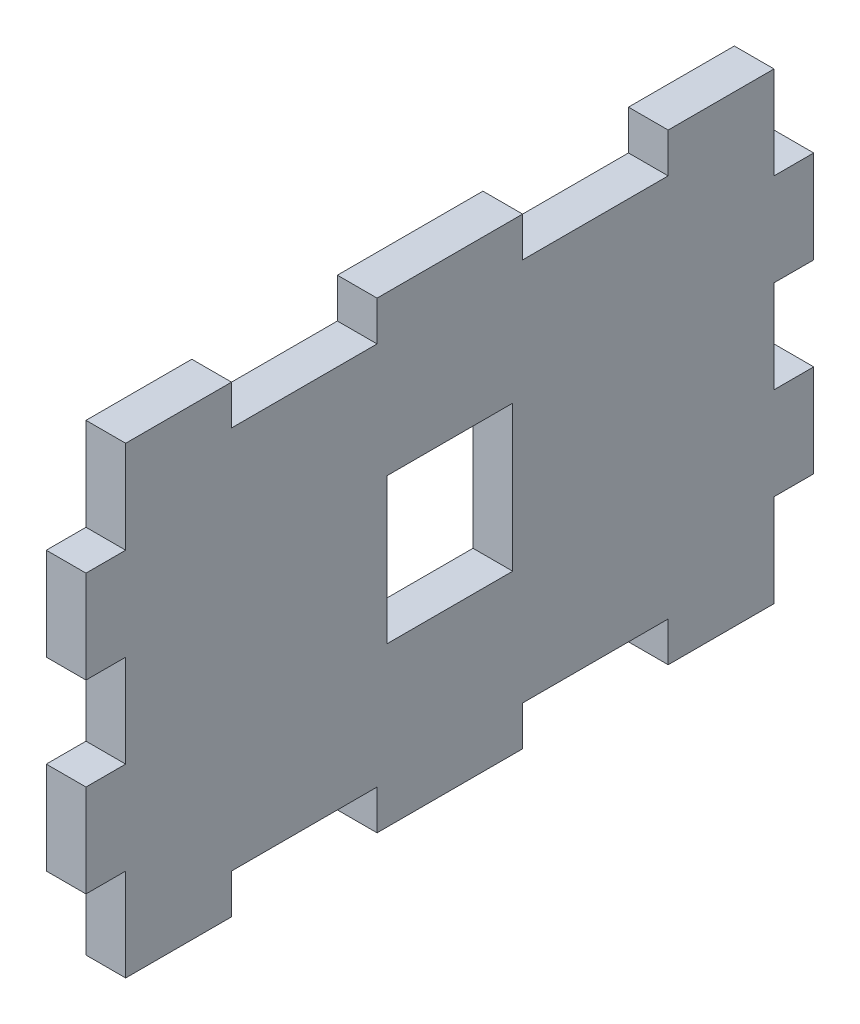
ISO-10303-21;
HEADER;
FILE_DESCRIPTION(('STEP AP214'),'2;1');
FILE_NAME('part.step','',(''),(''),'','','');
FILE_SCHEMA(('AUTOMOTIVE_DESIGN { 1 0 10303 214 1 1 1 1 }'));
ENDSEC;
DATA;
#1=APPLICATION_CONTEXT('core data for automotive mechanical design processes');
#2=APPLICATION_PROTOCOL_DEFINITION('international standard','automotive_design',2000,#1);
#3=PRODUCT_CONTEXT('',#1,'mechanical');
#4=PRODUCT('Part','Part','',(#3));
#5=PRODUCT_RELATED_PRODUCT_CATEGORY('part','',(#4));
#6=PRODUCT_DEFINITION_FORMATION('','',#4);
#7=PRODUCT_DEFINITION_CONTEXT('part definition',#1,'design');
#8=PRODUCT_DEFINITION('design','',#6,#7);
#9=PRODUCT_DEFINITION_SHAPE('','',#8);
#10=(LENGTH_UNIT() NAMED_UNIT(*) SI_UNIT(.MILLI.,.METRE.));
#11=(NAMED_UNIT(*) PLANE_ANGLE_UNIT() SI_UNIT($,.RADIAN.));
#12=(NAMED_UNIT(*) SI_UNIT($,.STERADIAN.) SOLID_ANGLE_UNIT());
#13=UNCERTAINTY_MEASURE_WITH_UNIT(LENGTH_MEASURE(1.E-05),#10,'distance_accuracy_value','');
#14=(GEOMETRIC_REPRESENTATION_CONTEXT(3) GLOBAL_UNCERTAINTY_ASSIGNED_CONTEXT((#13)) GLOBAL_UNIT_ASSIGNED_CONTEXT((#10,
#11,#12)) REPRESENTATION_CONTEXT('',''));
#15=CARTESIAN_POINT('',(0.,0.,0.));
#16=DIRECTION('',(0.,0.,1.));
#17=DIRECTION('',(1.,0.,0.));
#18=AXIS2_PLACEMENT_3D('',#15,#16,#17);
#19=CARTESIAN_POINT('',(3.,0.,0.));
#20=DIRECTION('',(1.,0.,0.));
#21=DIRECTION('',(0.,0.,-1.));
#22=AXIS2_PLACEMENT_3D('',#19,#20,#21);
#23=PLANE('',#22);
#24=DIRECTION('',(0.,1.,0.));
#25=VECTOR('',#24,1.);
#26=CARTESIAN_POINT('',(3.,5.5,-4.75));
#27=LINE('',#26,#25);
#28=CARTESIAN_POINT('',(3.,-5.5,-4.75));
#29=VERTEX_POINT('',#28);
#30=CARTESIAN_POINT('',(3.,5.5,-4.75));
#31=VERTEX_POINT('',#30);
#32=EDGE_CURVE('E49',#29,#31,#27,.T.);
#33=ORIENTED_EDGE('',*,*,#32,.F.);
#34=DIRECTION('',(0.,0.,-1.));
#35=VECTOR('',#34,1.);
#36=CARTESIAN_POINT('',(3.,-5.5,4.75));
#37=LINE('',#36,#35);
#38=CARTESIAN_POINT('',(3.,-5.5,4.75));
#39=VERTEX_POINT('',#38);
#40=EDGE_CURVE('E309',#39,#29,#37,.T.);
#41=ORIENTED_EDGE('',*,*,#40,.F.);
#42=DIRECTION('',(0.,-1.,0.));
#43=VECTOR('',#42,1.);
#44=CARTESIAN_POINT('',(3.,5.5,4.75));
#45=LINE('',#44,#43);
#46=CARTESIAN_POINT('',(3.,5.5,4.75));
#47=VERTEX_POINT('',#46);
#48=EDGE_CURVE('E294',#47,#39,#45,.T.);
#49=ORIENTED_EDGE('',*,*,#48,.F.);
#50=DIRECTION('',(0.,0.,1.));
#51=VECTOR('',#50,1.);
#52=CARTESIAN_POINT('',(3.,5.5,4.75));
#53=LINE('',#52,#51);
#54=EDGE_CURVE('E303',#31,#47,#53,.T.);
#55=ORIENTED_EDGE('',*,*,#54,.F.);
#56=EDGE_LOOP('',(#33,#41,#49,#55));
#57=FACE_BOUND('',#56,.T.);
#58=DIRECTION('',(0.,-1.,0.));
#59=VECTOR('',#58,1.);
#60=CARTESIAN_POINT('',(3.,0.,24.5));
#61=LINE('',#60,#59);
#62=CARTESIAN_POINT('',(3.,3.5,24.5));
#63=VERTEX_POINT('',#62);
#64=CARTESIAN_POINT('',(3.,-3.5,24.5));
#65=VERTEX_POINT('',#64);
#66=EDGE_CURVE('E333',#63,#65,#61,.T.);
#67=ORIENTED_EDGE('',*,*,#66,.T.);
#68=DIRECTION('',(0.,0.,1.));
#69=VECTOR('',#68,1.);
#70=CARTESIAN_POINT('',(3.,-3.5,0.));
#71=LINE('',#70,#69);
#72=CARTESIAN_POINT('',(3.,-3.5,27.5));
#73=VERTEX_POINT('',#72);
#74=EDGE_CURVE('E337',#65,#73,#71,.T.);
#75=ORIENTED_EDGE('',*,*,#74,.T.);
#76=DIRECTION('',(0.,-1.,0.));
#77=VECTOR('',#76,1.);
#78=CARTESIAN_POINT('',(3.,17.5,27.5));
#79=LINE('',#78,#77);
#80=CARTESIAN_POINT('',(3.,-10.5,27.5));
#81=VERTEX_POINT('',#80);
#82=EDGE_CURVE('E552',#73,#81,#79,.T.);
#83=ORIENTED_EDGE('',*,*,#82,.T.);
#84=DIRECTION('',(0.,0.,-1.));
#85=VECTOR('',#84,1.);
#86=CARTESIAN_POINT('',(3.,-10.5,0.));
#87=LINE('',#86,#85);
#88=CARTESIAN_POINT('',(3.,-10.5,24.5));
#89=VERTEX_POINT('',#88);
#90=EDGE_CURVE('E354',#81,#89,#87,.T.);
#91=ORIENTED_EDGE('',*,*,#90,.T.);
#92=DIRECTION('',(0.,-1.,0.));
#93=VECTOR('',#92,1.);
#94=CARTESIAN_POINT('',(3.,0.,24.5));
#95=LINE('',#94,#93);
#96=CARTESIAN_POINT('',(3.,-17.5,24.5));
#97=VERTEX_POINT('',#96);
#98=EDGE_CURVE('E329',#89,#97,#95,.T.);
#99=ORIENTED_EDGE('',*,*,#98,.T.);
#100=DIRECTION('',(0.,0.,-1.));
#101=VECTOR('',#100,1.);
#102=CARTESIAN_POINT('',(3.,-17.5,27.5));
#103=LINE('',#102,#101);
#104=CARTESIAN_POINT('',(3.,-17.5,16.5));
#105=VERTEX_POINT('',#104);
#106=EDGE_CURVE('E559',#97,#105,#103,.T.);
#107=ORIENTED_EDGE('',*,*,#106,.T.);
#108=DIRECTION('',(0.,1.,0.));
#109=VECTOR('',#108,1.);
#110=CARTESIAN_POINT('',(3.,0.,16.5));
#111=LINE('',#110,#109);
#112=CARTESIAN_POINT('',(3.,-14.5,16.5));
#113=VERTEX_POINT('',#112);
#114=EDGE_CURVE('E434',#105,#113,#111,.T.);
#115=ORIENTED_EDGE('',*,*,#114,.T.);
#116=DIRECTION('',(0.,0.,-1.));
#117=VECTOR('',#116,1.);
#118=CARTESIAN_POINT('',(3.,-14.5,0.));
#119=LINE('',#118,#117);
#120=CARTESIAN_POINT('',(3.,-14.5,5.5));
#121=VERTEX_POINT('',#120);
#122=EDGE_CURVE('E497',#113,#121,#119,.T.);
#123=ORIENTED_EDGE('',*,*,#122,.T.);
#124=DIRECTION('',(0.,-1.,0.));
#125=VECTOR('',#124,1.);
#126=CARTESIAN_POINT('',(3.,0.,5.5));
#127=LINE('',#126,#125);
#128=CARTESIAN_POINT('',(3.,-17.5,5.5));
#129=VERTEX_POINT('',#128);
#130=EDGE_CURVE('E505',#121,#129,#127,.T.);
#131=ORIENTED_EDGE('',*,*,#130,.T.);
#132=CARTESIAN_POINT('',(3.,-17.5,-5.5));
#133=VERTEX_POINT('',#132);
#134=EDGE_CURVE('E562',#129,#133,#103,.T.);
#135=ORIENTED_EDGE('',*,*,#134,.T.);
#136=DIRECTION('',(0.,1.,0.));
#137=VECTOR('',#136,1.);
#138=CARTESIAN_POINT('',(3.,0.,-5.5));
#139=LINE('',#138,#137);
#140=CARTESIAN_POINT('',(3.,-14.5,-5.5));
#141=VERTEX_POINT('',#140);
#142=EDGE_CURVE('E477',#133,#141,#139,.T.);
#143=ORIENTED_EDGE('',*,*,#142,.T.);
#144=DIRECTION('',(0.,0.,-1.));
#145=VECTOR('',#144,1.);
#146=CARTESIAN_POINT('',(3.,-14.5,0.));
#147=LINE('',#146,#145);
#148=CARTESIAN_POINT('',(3.,-14.5,-16.5));
#149=VERTEX_POINT('',#148);
#150=EDGE_CURVE('E471',#141,#149,#147,.T.);
#151=ORIENTED_EDGE('',*,*,#150,.T.);
#152=DIRECTION('',(0.,-1.,0.));
#153=VECTOR('',#152,1.);
#154=CARTESIAN_POINT('',(3.,0.,-16.5));
#155=LINE('',#154,#153);
#156=CARTESIAN_POINT('',(3.,-17.5,-16.5));
#157=VERTEX_POINT('',#156);
#158=EDGE_CURVE('E480',#149,#157,#155,.T.);
#159=ORIENTED_EDGE('',*,*,#158,.T.);
#160=CARTESIAN_POINT('',(3.,-17.5,-24.5));
#161=VERTEX_POINT('',#160);
#162=EDGE_CURVE('E558',#157,#161,#103,.T.);
#163=ORIENTED_EDGE('',*,*,#162,.T.);
#164=DIRECTION('',(0.,-1.,0.));
#165=VECTOR('',#164,1.);
#166=CARTESIAN_POINT('',(3.,0.,-24.5));
#167=LINE('',#166,#165);
#168=CARTESIAN_POINT('',(3.,-10.5,-24.5));
#169=VERTEX_POINT('',#168);
#170=EDGE_CURVE('E413',#169,#161,#167,.T.);
#171=ORIENTED_EDGE('',*,*,#170,.F.);
#172=DIRECTION('',(0.,0.,1.));
#173=VECTOR('',#172,1.);
#174=CARTESIAN_POINT('',(3.,-10.5,0.));
#175=LINE('',#174,#173);
#176=CARTESIAN_POINT('',(3.,-10.5,-27.5));
#177=VERTEX_POINT('',#176);
#178=EDGE_CURVE('E390',#177,#169,#175,.T.);
#179=ORIENTED_EDGE('',*,*,#178,.F.);
#180=DIRECTION('',(0.,1.,0.));
#181=VECTOR('',#180,1.);
#182=CARTESIAN_POINT('',(3.,17.5,-27.5));
#183=LINE('',#182,#181);
#184=CARTESIAN_POINT('',(3.,-3.5,-27.5));
#185=VERTEX_POINT('',#184);
#186=EDGE_CURVE('E548',#177,#185,#183,.T.);
#187=ORIENTED_EDGE('',*,*,#186,.T.);
#188=DIRECTION('',(0.,0.,-1.));
#189=VECTOR('',#188,1.);
#190=CARTESIAN_POINT('',(3.,-3.49999999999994,0.));
#191=LINE('',#190,#189);
#192=CARTESIAN_POINT('',(3.,-3.5,-24.5));
#193=VERTEX_POINT('',#192);
#194=EDGE_CURVE('E391',#193,#185,#191,.T.);
#195=ORIENTED_EDGE('',*,*,#194,.F.);
#196=DIRECTION('',(0.,-1.,0.));
#197=VECTOR('',#196,1.);
#198=CARTESIAN_POINT('',(3.,0.,-24.5));
#199=LINE('',#198,#197);
#200=CARTESIAN_POINT('',(3.,3.5,-24.5));
#201=VERTEX_POINT('',#200);
#202=EDGE_CURVE('E393',#201,#193,#199,.T.);
#203=ORIENTED_EDGE('',*,*,#202,.F.);
#204=DIRECTION('',(0.,0.,1.));
#205=VECTOR('',#204,1.);
#206=CARTESIAN_POINT('',(3.,3.50000000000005,0.));
#207=LINE('',#206,#205);
#208=CARTESIAN_POINT('',(3.,3.5,-27.5));
#209=VERTEX_POINT('',#208);
#210=EDGE_CURVE('E370',#209,#201,#207,.T.);
#211=ORIENTED_EDGE('',*,*,#210,.F.);
#212=CARTESIAN_POINT('',(3.,10.5,-27.5));
#213=VERTEX_POINT('',#212);
#214=EDGE_CURVE('E545',#209,#213,#183,.T.);
#215=ORIENTED_EDGE('',*,*,#214,.T.);
#216=DIRECTION('',(0.,0.,-1.));
#217=VECTOR('',#216,1.);
#218=CARTESIAN_POINT('',(3.,10.5,0.));
#219=LINE('',#218,#217);
#220=CARTESIAN_POINT('',(3.,10.5,-24.5));
#221=VERTEX_POINT('',#220);
#222=EDGE_CURVE('E371',#221,#213,#219,.T.);
#223=ORIENTED_EDGE('',*,*,#222,.F.);
#224=DIRECTION('',(0.,-1.,0.));
#225=VECTOR('',#224,1.);
#226=CARTESIAN_POINT('',(3.,0.,-24.5));
#227=LINE('',#226,#225);
#228=CARTESIAN_POINT('',(3.,17.5,-24.5));
#229=VERTEX_POINT('',#228);
#230=EDGE_CURVE('E353',#229,#221,#227,.T.);
#231=ORIENTED_EDGE('',*,*,#230,.F.);
#232=DIRECTION('',(0.,0.,1.));
#233=VECTOR('',#232,1.);
#234=CARTESIAN_POINT('',(3.,17.5,27.5));
#235=LINE('',#234,#233);
#236=CARTESIAN_POINT('',(3.,17.5,-16.5));
#237=VERTEX_POINT('',#236);
#238=EDGE_CURVE('E550',#229,#237,#235,.T.);
#239=ORIENTED_EDGE('',*,*,#238,.T.);
#240=DIRECTION('',(0.,1.,0.));
#241=VECTOR('',#240,1.);
#242=CARTESIAN_POINT('',(3.,0.,-16.5));
#243=LINE('',#242,#241);
#244=CARTESIAN_POINT('',(3.,14.5,-16.5));
#245=VERTEX_POINT('',#244);
#246=EDGE_CURVE('E453',#245,#237,#243,.T.);
#247=ORIENTED_EDGE('',*,*,#246,.F.);
#248=DIRECTION('',(0.,0.,-1.));
#249=VECTOR('',#248,1.);
#250=CARTESIAN_POINT('',(3.,14.5,0.));
#251=LINE('',#250,#249);
#252=CARTESIAN_POINT('',(3.,14.5,-5.5));
#253=VERTEX_POINT('',#252);
#254=EDGE_CURVE('E450',#253,#245,#251,.T.);
#255=ORIENTED_EDGE('',*,*,#254,.F.);
#256=DIRECTION('',(0.,-1.,0.));
#257=VECTOR('',#256,1.);
#258=CARTESIAN_POINT('',(3.,0.,-5.5));
#259=LINE('',#258,#257);
#260=CARTESIAN_POINT('',(3.,17.5,-5.5));
#261=VERTEX_POINT('',#260);
#262=EDGE_CURVE('E443',#261,#253,#259,.T.);
#263=ORIENTED_EDGE('',*,*,#262,.F.);
#264=CARTESIAN_POINT('',(3.,17.5,5.5));
#265=VERTEX_POINT('',#264);
#266=EDGE_CURVE('E553',#261,#265,#235,.T.);
#267=ORIENTED_EDGE('',*,*,#266,.T.);
#268=DIRECTION('',(0.,1.,0.));
#269=VECTOR('',#268,1.);
#270=CARTESIAN_POINT('',(3.,0.,5.5));
#271=LINE('',#270,#269);
#272=CARTESIAN_POINT('',(3.,14.5,5.5));
#273=VERTEX_POINT('',#272);
#274=EDGE_CURVE('E531',#273,#265,#271,.T.);
#275=ORIENTED_EDGE('',*,*,#274,.F.);
#276=DIRECTION('',(0.,0.,-1.));
#277=VECTOR('',#276,1.);
#278=CARTESIAN_POINT('',(3.,14.5,0.));
#279=LINE('',#278,#277);
#280=CARTESIAN_POINT('',(3.,14.5,16.5));
#281=VERTEX_POINT('',#280);
#282=EDGE_CURVE('E461',#281,#273,#279,.T.);
#283=ORIENTED_EDGE('',*,*,#282,.F.);
#284=DIRECTION('',(0.,-1.,0.));
#285=VECTOR('',#284,1.);
#286=CARTESIAN_POINT('',(3.,0.,16.5));
#287=LINE('',#286,#285);
#288=CARTESIAN_POINT('',(3.,17.5,16.5));
#289=VERTEX_POINT('',#288);
#290=EDGE_CURVE('E522',#289,#281,#287,.T.);
#291=ORIENTED_EDGE('',*,*,#290,.F.);
#292=CARTESIAN_POINT('',(3.,17.5,24.5));
#293=VERTEX_POINT('',#292);
#294=EDGE_CURVE('E554',#289,#293,#235,.T.);
#295=ORIENTED_EDGE('',*,*,#294,.T.);
#296=DIRECTION('',(0.,-1.,0.));
#297=VECTOR('',#296,1.);
#298=CARTESIAN_POINT('',(3.,0.,24.5));
#299=LINE('',#298,#297);
#300=CARTESIAN_POINT('',(3.,10.5,24.5));
#301=VERTEX_POINT('',#300);
#302=EDGE_CURVE('E425',#293,#301,#299,.T.);
#303=ORIENTED_EDGE('',*,*,#302,.T.);
#304=DIRECTION('',(0.,0.,1.));
#305=VECTOR('',#304,1.);
#306=CARTESIAN_POINT('',(3.,10.5,0.));
#307=LINE('',#306,#305);
#308=CARTESIAN_POINT('',(3.,10.5,27.5));
#309=VERTEX_POINT('',#308);
#310=EDGE_CURVE('E340',#301,#309,#307,.T.);
#311=ORIENTED_EDGE('',*,*,#310,.T.);
#312=CARTESIAN_POINT('',(3.,3.5,27.5));
#313=VERTEX_POINT('',#312);
#314=EDGE_CURVE('E555',#309,#313,#79,.T.);
#315=ORIENTED_EDGE('',*,*,#314,.T.);
#316=DIRECTION('',(0.,0.,-1.));
#317=VECTOR('',#316,1.);
#318=CARTESIAN_POINT('',(3.,3.5,0.));
#319=LINE('',#318,#317);
#320=EDGE_CURVE('E330',#313,#63,#319,.T.);
#321=ORIENTED_EDGE('',*,*,#320,.T.);
#322=EDGE_LOOP('',(#67,#75,#83,#91,#99,#107,#115,#123,#131,#135,#143,#151,#159,#163,#171,#179,
#187,#195,#203,#211,#215,#223,#231,#239,#247,#255,#263,#267,#275,#283,#291,#295,#303,#311,#315,#321));
#323=FACE_BOUND('',#322,.T.);
#324=ADVANCED_FACE('F34',(#57,#323),#23,.T.);
#325=CARTESIAN_POINT('',(0.,0.,0.));
#326=DIRECTION('',(1.,0.,0.));
#327=DIRECTION('',(0.,0.,-1.));
#328=AXIS2_PLACEMENT_3D('',#325,#326,#327);
#329=PLANE('',#328);
#330=DIRECTION('',(0.,0.,-1.));
#331=VECTOR('',#330,1.);
#332=CARTESIAN_POINT('',(0.,-5.5,0.));
#333=LINE('',#332,#331);
#334=CARTESIAN_POINT('',(0.,-5.5,4.75));
#335=VERTEX_POINT('',#334);
#336=CARTESIAN_POINT('',(0.,-5.5,-4.75));
#337=VERTEX_POINT('',#336);
#338=EDGE_CURVE('E42',#335,#337,#333,.T.);
#339=ORIENTED_EDGE('',*,*,#338,.T.);
#340=DIRECTION('',(0.,1.,0.));
#341=VECTOR('',#340,1.);
#342=CARTESIAN_POINT('',(0.,0.,-4.75));
#343=LINE('',#342,#341);
#344=CARTESIAN_POINT('',(0.,5.5,-4.75));
#345=VERTEX_POINT('',#344);
#346=EDGE_CURVE('E12',#337,#345,#343,.T.);
#347=ORIENTED_EDGE('',*,*,#346,.T.);
#348=DIRECTION('',(0.,0.,1.));
#349=VECTOR('',#348,1.);
#350=CARTESIAN_POINT('',(0.,5.5,0.));
#351=LINE('',#350,#349);
#352=CARTESIAN_POINT('',(0.,5.5,4.75));
#353=VERTEX_POINT('',#352);
#354=EDGE_CURVE('E561',#345,#353,#351,.T.);
#355=ORIENTED_EDGE('',*,*,#354,.T.);
#356=DIRECTION('',(0.,-1.,0.));
#357=VECTOR('',#356,1.);
#358=CARTESIAN_POINT('',(0.,0.,4.75));
#359=LINE('',#358,#357);
#360=EDGE_CURVE('E297',#353,#335,#359,.T.);
#361=ORIENTED_EDGE('',*,*,#360,.T.);
#362=EDGE_LOOP('',(#339,#347,#355,#361));
#363=FACE_BOUND('',#362,.T.);
#364=DIRECTION('',(0.,0.,1.));
#365=VECTOR('',#364,1.);
#366=CARTESIAN_POINT('',(0.,-3.5,0.));
#367=LINE('',#366,#365);
#368=CARTESIAN_POINT('',(0.,-3.5,24.5));
#369=VERTEX_POINT('',#368);
#370=CARTESIAN_POINT('',(0.,-3.5,27.5));
#371=VERTEX_POINT('',#370);
#372=EDGE_CURVE('E334',#369,#371,#367,.T.);
#373=ORIENTED_EDGE('',*,*,#372,.F.);
#374=DIRECTION('',(0.,-1.,0.));
#375=VECTOR('',#374,1.);
#376=CARTESIAN_POINT('',(0.,0.,24.5));
#377=LINE('',#376,#375);
#378=CARTESIAN_POINT('',(0.,3.5,24.5));
#379=VERTEX_POINT('',#378);
#380=EDGE_CURVE('E342',#379,#369,#377,.T.);
#381=ORIENTED_EDGE('',*,*,#380,.F.);
#382=DIRECTION('',(0.,0.,-1.));
#383=VECTOR('',#382,1.);
#384=CARTESIAN_POINT('',(0.,3.5,0.));
#385=LINE('',#384,#383);
#386=CARTESIAN_POINT('',(0.,3.5,27.5));
#387=VERTEX_POINT('',#386);
#388=EDGE_CURVE('E321',#387,#379,#385,.T.);
#389=ORIENTED_EDGE('',*,*,#388,.F.);
#390=DIRECTION('',(0.,-1.,0.));
#391=VECTOR('',#390,1.);
#392=CARTESIAN_POINT('',(0.,17.5,27.5));
#393=LINE('',#392,#391);
#394=CARTESIAN_POINT('',(0.,10.5,27.5));
#395=VERTEX_POINT('',#394);
#396=EDGE_CURVE('E571',#395,#387,#393,.T.);
#397=ORIENTED_EDGE('',*,*,#396,.F.);
#398=DIRECTION('',(0.,0.,1.));
#399=VECTOR('',#398,1.);
#400=CARTESIAN_POINT('',(0.,10.5,0.));
#401=LINE('',#400,#399);
#402=CARTESIAN_POINT('',(0.,10.5,24.5));
#403=VERTEX_POINT('',#402);
#404=EDGE_CURVE('E422',#403,#395,#401,.T.);
#405=ORIENTED_EDGE('',*,*,#404,.F.);
#406=DIRECTION('',(0.,-1.,0.));
#407=VECTOR('',#406,1.);
#408=CARTESIAN_POINT('',(0.,0.,24.5));
#409=LINE('',#408,#407);
#410=CARTESIAN_POINT('',(0.,17.5,24.5));
#411=VERTEX_POINT('',#410);
#412=EDGE_CURVE('E424',#411,#403,#409,.T.);
#413=ORIENTED_EDGE('',*,*,#412,.F.);
#414=DIRECTION('',(0.,0.,1.));
#415=VECTOR('',#414,1.);
#416=CARTESIAN_POINT('',(0.,17.5,27.5));
#417=LINE('',#416,#415);
#418=CARTESIAN_POINT('',(0.,17.5,16.5));
#419=VERTEX_POINT('',#418);
#420=EDGE_CURVE('E570',#419,#411,#417,.T.);
#421=ORIENTED_EDGE('',*,*,#420,.F.);
#422=DIRECTION('',(0.,-1.,0.));
#423=VECTOR('',#422,1.);
#424=CARTESIAN_POINT('',(0.,0.,16.5));
#425=LINE('',#424,#423);
#426=CARTESIAN_POINT('',(0.,14.5,16.5));
#427=VERTEX_POINT('',#426);
#428=EDGE_CURVE('E525',#419,#427,#425,.T.);
#429=ORIENTED_EDGE('',*,*,#428,.T.);
#430=DIRECTION('',(0.,0.,-1.));
#431=VECTOR('',#430,1.);
#432=CARTESIAN_POINT('',(0.,14.5,0.));
#433=LINE('',#432,#431);
#434=CARTESIAN_POINT('',(0.,14.5,5.5));
#435=VERTEX_POINT('',#434);
#436=EDGE_CURVE('E518',#427,#435,#433,.T.);
#437=ORIENTED_EDGE('',*,*,#436,.T.);
#438=DIRECTION('',(0.,1.,0.));
#439=VECTOR('',#438,1.);
#440=CARTESIAN_POINT('',(0.,0.,5.5));
#441=LINE('',#440,#439);
#442=CARTESIAN_POINT('',(0.,17.5,5.5));
#443=VERTEX_POINT('',#442);
#444=EDGE_CURVE('E521',#435,#443,#441,.T.);
#445=ORIENTED_EDGE('',*,*,#444,.T.);
#446=CARTESIAN_POINT('',(0.,17.5,-5.5));
#447=VERTEX_POINT('',#446);
#448=EDGE_CURVE('E569',#447,#443,#417,.T.);
#449=ORIENTED_EDGE('',*,*,#448,.F.);
#450=DIRECTION('',(0.,-1.,0.));
#451=VECTOR('',#450,1.);
#452=CARTESIAN_POINT('',(0.,0.,-5.5));
#453=LINE('',#452,#451);
#454=CARTESIAN_POINT('',(0.,14.5,-5.5));
#455=VERTEX_POINT('',#454);
#456=EDGE_CURVE('E446',#447,#455,#453,.T.);
#457=ORIENTED_EDGE('',*,*,#456,.T.);
#458=DIRECTION('',(0.,0.,-1.));
#459=VECTOR('',#458,1.);
#460=CARTESIAN_POINT('',(0.,14.5,0.));
#461=LINE('',#460,#459);
#462=CARTESIAN_POINT('',(0.,14.5,-16.5));
#463=VERTEX_POINT('',#462);
#464=EDGE_CURVE('E439',#455,#463,#461,.T.);
#465=ORIENTED_EDGE('',*,*,#464,.T.);
#466=DIRECTION('',(0.,1.,0.));
#467=VECTOR('',#466,1.);
#468=CARTESIAN_POINT('',(0.,0.,-16.5));
#469=LINE('',#468,#467);
#470=CARTESIAN_POINT('',(0.,17.5,-16.5));
#471=VERTEX_POINT('',#470);
#472=EDGE_CURVE('E442',#463,#471,#469,.T.);
#473=ORIENTED_EDGE('',*,*,#472,.T.);
#474=CARTESIAN_POINT('',(0.,17.5,-24.5));
#475=VERTEX_POINT('',#474);
#476=EDGE_CURVE('E566',#475,#471,#417,.T.);
#477=ORIENTED_EDGE('',*,*,#476,.F.);
#478=DIRECTION('',(0.,-1.,0.));
#479=VECTOR('',#478,1.);
#480=CARTESIAN_POINT('',(0.,0.,-24.5));
#481=LINE('',#480,#479);
#482=CARTESIAN_POINT('',(0.,10.5,-24.5));
#483=VERTEX_POINT('',#482);
#484=EDGE_CURVE('E373',#475,#483,#481,.T.);
#485=ORIENTED_EDGE('',*,*,#484,.T.);
#486=DIRECTION('',(0.,0.,-1.));
#487=VECTOR('',#486,1.);
#488=CARTESIAN_POINT('',(0.,10.5,0.));
#489=LINE('',#488,#487);
#490=CARTESIAN_POINT('',(0.,10.5,-27.5));
#491=VERTEX_POINT('',#490);
#492=EDGE_CURVE('E364',#483,#491,#489,.T.);
#493=ORIENTED_EDGE('',*,*,#492,.T.);
#494=DIRECTION('',(0.,1.,0.));
#495=VECTOR('',#494,1.);
#496=CARTESIAN_POINT('',(0.,17.5,-27.5));
#497=LINE('',#496,#495);
#498=CARTESIAN_POINT('',(0.,3.5,-27.5));
#499=VERTEX_POINT('',#498);
#500=EDGE_CURVE('E538',#499,#491,#497,.T.);
#501=ORIENTED_EDGE('',*,*,#500,.F.);
#502=DIRECTION('',(0.,0.,1.));
#503=VECTOR('',#502,1.);
#504=CARTESIAN_POINT('',(0.,3.50000000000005,0.));
#505=LINE('',#504,#503);
#506=CARTESIAN_POINT('',(0.,3.5,-24.5));
#507=VERTEX_POINT('',#506);
#508=EDGE_CURVE('E394',#499,#507,#505,.T.);
#509=ORIENTED_EDGE('',*,*,#508,.T.);
#510=DIRECTION('',(0.,-1.,0.));
#511=VECTOR('',#510,1.);
#512=CARTESIAN_POINT('',(0.,0.,-24.5));
#513=LINE('',#512,#511);
#514=CARTESIAN_POINT('',(0.,-3.5,-24.5));
#515=VERTEX_POINT('',#514);
#516=EDGE_CURVE('E401',#507,#515,#513,.T.);
#517=ORIENTED_EDGE('',*,*,#516,.T.);
#518=DIRECTION('',(0.,0.,-1.));
#519=VECTOR('',#518,1.);
#520=CARTESIAN_POINT('',(0.,-3.49999999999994,0.));
#521=LINE('',#520,#519);
#522=CARTESIAN_POINT('',(0.,-3.5,-27.5));
#523=VERTEX_POINT('',#522);
#524=EDGE_CURVE('E382',#515,#523,#521,.T.);
#525=ORIENTED_EDGE('',*,*,#524,.T.);
#526=CARTESIAN_POINT('',(0.,-10.5,-27.5));
#527=VERTEX_POINT('',#526);
#528=EDGE_CURVE('E565',#527,#523,#497,.T.);
#529=ORIENTED_EDGE('',*,*,#528,.F.);
#530=DIRECTION('',(0.,0.,1.));
#531=VECTOR('',#530,1.);
#532=CARTESIAN_POINT('',(0.,-10.5,0.));
#533=LINE('',#532,#531);
#534=CARTESIAN_POINT('',(0.,-10.5,-24.5));
#535=VERTEX_POINT('',#534);
#536=EDGE_CURVE('E415',#527,#535,#533,.T.);
#537=ORIENTED_EDGE('',*,*,#536,.T.);
#538=DIRECTION('',(0.,-1.,0.));
#539=VECTOR('',#538,1.);
#540=CARTESIAN_POINT('',(0.,0.,-24.5));
#541=LINE('',#540,#539);
#542=CARTESIAN_POINT('',(0.,-17.5,-24.5));
#543=VERTEX_POINT('',#542);
#544=EDGE_CURVE('E408',#535,#543,#541,.T.);
#545=ORIENTED_EDGE('',*,*,#544,.T.);
#546=DIRECTION('',(0.,0.,-1.));
#547=VECTOR('',#546,1.);
#548=CARTESIAN_POINT('',(0.,-17.5,27.5));
#549=LINE('',#548,#547);
#550=CARTESIAN_POINT('',(0.,-17.5,-16.5));
#551=VERTEX_POINT('',#550);
#552=EDGE_CURVE('E574',#551,#543,#549,.T.);
#553=ORIENTED_EDGE('',*,*,#552,.F.);
#554=DIRECTION('',(0.,-1.,0.));
#555=VECTOR('',#554,1.);
#556=CARTESIAN_POINT('',(0.,0.,-16.5));
#557=LINE('',#556,#555);
#558=CARTESIAN_POINT('',(0.,-14.5,-16.5));
#559=VERTEX_POINT('',#558);
#560=EDGE_CURVE('E470',#559,#551,#557,.T.);
#561=ORIENTED_EDGE('',*,*,#560,.F.);
#562=DIRECTION('',(0.,0.,-1.));
#563=VECTOR('',#562,1.);
#564=CARTESIAN_POINT('',(0.,-14.5,0.));
#565=LINE('',#564,#563);
#566=CARTESIAN_POINT('',(0.,-14.5,-5.5));
#567=VERTEX_POINT('',#566);
#568=EDGE_CURVE('E473',#567,#559,#565,.T.);
#569=ORIENTED_EDGE('',*,*,#568,.F.);
#570=DIRECTION('',(0.,1.,0.));
#571=VECTOR('',#570,1.);
#572=CARTESIAN_POINT('',(0.,0.,-5.5));
#573=LINE('',#572,#571);
#574=CARTESIAN_POINT('',(0.,-17.5,-5.5));
#575=VERTEX_POINT('',#574);
#576=EDGE_CURVE('E468',#575,#567,#573,.T.);
#577=ORIENTED_EDGE('',*,*,#576,.F.);
#578=CARTESIAN_POINT('',(0.,-17.5,5.5));
#579=VERTEX_POINT('',#578);
#580=EDGE_CURVE('E576',#579,#575,#549,.T.);
#581=ORIENTED_EDGE('',*,*,#580,.F.);
#582=DIRECTION('',(0.,-1.,0.));
#583=VECTOR('',#582,1.);
#584=CARTESIAN_POINT('',(0.,0.,5.5));
#585=LINE('',#584,#583);
#586=CARTESIAN_POINT('',(0.,-14.5,5.5));
#587=VERTEX_POINT('',#586);
#588=EDGE_CURVE('E496',#587,#579,#585,.T.);
#589=ORIENTED_EDGE('',*,*,#588,.F.);
#590=DIRECTION('',(0.,0.,-1.));
#591=VECTOR('',#590,1.);
#592=CARTESIAN_POINT('',(0.,-14.5,0.));
#593=LINE('',#592,#591);
#594=CARTESIAN_POINT('',(0.,-14.5,16.5));
#595=VERTEX_POINT('',#594);
#596=EDGE_CURVE('E499',#595,#587,#593,.T.);
#597=ORIENTED_EDGE('',*,*,#596,.F.);
#598=DIRECTION('',(0.,1.,0.));
#599=VECTOR('',#598,1.);
#600=CARTESIAN_POINT('',(0.,0.,16.5));
#601=LINE('',#600,#599);
#602=CARTESIAN_POINT('',(0.,-17.5,16.5));
#603=VERTEX_POINT('',#602);
#604=EDGE_CURVE('E494',#603,#595,#601,.T.);
#605=ORIENTED_EDGE('',*,*,#604,.F.);
#606=CARTESIAN_POINT('',(0.,-17.5,24.5));
#607=VERTEX_POINT('',#606);
#608=EDGE_CURVE('E549',#607,#603,#549,.T.);
#609=ORIENTED_EDGE('',*,*,#608,.F.);
#610=DIRECTION('',(0.,-1.,0.));
#611=VECTOR('',#610,1.);
#612=CARTESIAN_POINT('',(0.,0.,24.5));
#613=LINE('',#612,#611);
#614=CARTESIAN_POINT('',(0.,-10.5,24.5));
#615=VERTEX_POINT('',#614);
#616=EDGE_CURVE('E357',#615,#607,#613,.T.);
#617=ORIENTED_EDGE('',*,*,#616,.F.);
#618=DIRECTION('',(0.,0.,-1.));
#619=VECTOR('',#618,1.);
#620=CARTESIAN_POINT('',(0.,-10.5,0.));
#621=LINE('',#620,#619);
#622=CARTESIAN_POINT('',(0.,-10.5,27.5));
#623=VERTEX_POINT('',#622);
#624=EDGE_CURVE('E347',#623,#615,#621,.T.);
#625=ORIENTED_EDGE('',*,*,#624,.F.);
#626=EDGE_CURVE('E568',#371,#623,#393,.T.);
#627=ORIENTED_EDGE('',*,*,#626,.F.);
#628=EDGE_LOOP('',(#373,#381,#389,#397,#405,#413,#421,#429,#437,#445,#449,#457,#465,#473,#477,
#485,#493,#501,#509,#517,#525,#529,#537,#545,#553,#561,#569,#577,#581,#589,#597,#605,#609,#617,
#625,#627));
#629=FACE_BOUND('',#628,.T.);
#630=ADVANCED_FACE('F580',(#363,#629),#329,.F.);
#631=CARTESIAN_POINT('',(3.,17.5,27.5));
#632=DIRECTION('',(0.,0.,-1.));
#633=DIRECTION('',(0.,1.,0.));
#634=AXIS2_PLACEMENT_3D('',#631,#632,#633);
#635=PLANE('',#634);
#636=DIRECTION('',(1.,0.,0.));
#637=VECTOR('',#636,1.);
#638=CARTESIAN_POINT('',(0.,-3.5,27.5));
#639=LINE('',#638,#637);
#640=EDGE_CURVE('E327',#371,#73,#639,.T.);
#641=ORIENTED_EDGE('',*,*,#640,.F.);
#642=ORIENTED_EDGE('',*,*,#626,.T.);
#643=DIRECTION('',(1.,0.,0.));
#644=VECTOR('',#643,1.);
#645=CARTESIAN_POINT('',(0.,-10.5,27.5));
#646=LINE('',#645,#644);
#647=EDGE_CURVE('E348',#623,#81,#646,.T.);
#648=ORIENTED_EDGE('',*,*,#647,.T.);
#649=ORIENTED_EDGE('',*,*,#82,.F.);
#650=EDGE_LOOP('',(#641,#642,#648,#649));
#651=FACE_BOUND('',#650,.T.);
#652=ADVANCED_FACE('F604',(#651),#635,.F.);
#653=DIRECTION('',(1.,0.,0.));
#654=VECTOR('',#653,1.);
#655=CARTESIAN_POINT('',(0.,3.5,27.5));
#656=LINE('',#655,#654);
#657=EDGE_CURVE('E324',#387,#313,#656,.T.);
#658=ORIENTED_EDGE('',*,*,#657,.T.);
#659=ORIENTED_EDGE('',*,*,#314,.F.);
#660=DIRECTION('',(1.,0.,0.));
#661=VECTOR('',#660,1.);
#662=CARTESIAN_POINT('',(0.,10.5,27.5));
#663=LINE('',#662,#661);
#664=EDGE_CURVE('E432',#395,#309,#663,.T.);
#665=ORIENTED_EDGE('',*,*,#664,.F.);
#666=ORIENTED_EDGE('',*,*,#396,.T.);
#667=EDGE_LOOP('',(#658,#659,#665,#666));
#668=FACE_BOUND('',#667,.T.);
#669=ADVANCED_FACE('F618',(#668),#635,.F.);
#670=CARTESIAN_POINT('',(3.,-17.5,27.5));
#671=DIRECTION('',(0.,1.,0.));
#672=DIRECTION('',(0.,0.,1.));
#673=AXIS2_PLACEMENT_3D('',#670,#671,#672);
#674=PLANE('',#673);
#675=DIRECTION('',(1.,0.,0.));
#676=VECTOR('',#675,1.);
#677=CARTESIAN_POINT('',(0.,-17.5,24.5));
#678=LINE('',#677,#676);
#679=EDGE_CURVE('E351',#607,#97,#678,.T.);
#680=ORIENTED_EDGE('',*,*,#679,.F.);
#681=ORIENTED_EDGE('',*,*,#608,.T.);
#682=DIRECTION('',(1.,0.,0.));
#683=VECTOR('',#682,1.);
#684=CARTESIAN_POINT('',(0.,-17.5,16.5));
#685=LINE('',#684,#683);
#686=EDGE_CURVE('E502',#603,#105,#685,.T.);
#687=ORIENTED_EDGE('',*,*,#686,.T.);
#688=ORIENTED_EDGE('',*,*,#106,.F.);
#689=EDGE_LOOP('',(#680,#681,#687,#688));
#690=FACE_BOUND('',#689,.T.);
#691=ADVANCED_FACE('F616',(#690),#674,.F.);
#692=CARTESIAN_POINT('',(3.,17.5,-27.5));
#693=DIRECTION('',(0.,0.,1.));
#694=DIRECTION('',(0.,-1.,0.));
#695=AXIS2_PLACEMENT_3D('',#692,#693,#694);
#696=PLANE('',#695);
#697=ORIENTED_EDGE('',*,*,#528,.T.);
#698=DIRECTION('',(1.,0.,0.));
#699=VECTOR('',#698,1.);
#700=CARTESIAN_POINT('',(0.,-3.5,-27.5));
#701=LINE('',#700,#699);
#702=EDGE_CURVE('E387',#523,#185,#701,.T.);
#703=ORIENTED_EDGE('',*,*,#702,.T.);
#704=ORIENTED_EDGE('',*,*,#186,.F.);
#705=DIRECTION('',(1.,0.,0.));
#706=VECTOR('',#705,1.);
#707=CARTESIAN_POINT('',(0.,-10.5,-27.5));
#708=LINE('',#707,#706);
#709=EDGE_CURVE('E406',#527,#177,#708,.T.);
#710=ORIENTED_EDGE('',*,*,#709,.F.);
#711=EDGE_LOOP('',(#697,#703,#704,#710));
#712=FACE_BOUND('',#711,.T.);
#713=ADVANCED_FACE('F631',(#712),#696,.F.);
#714=CARTESIAN_POINT('',(3.,17.5,27.5));
#715=DIRECTION('',(0.,-1.,0.));
#716=DIRECTION('',(0.,0.,-1.));
#717=AXIS2_PLACEMENT_3D('',#714,#715,#716);
#718=PLANE('',#717);
#719=DIRECTION('',(1.,0.,0.));
#720=VECTOR('',#719,1.);
#721=CARTESIAN_POINT('',(0.,17.5,24.5));
#722=LINE('',#721,#720);
#723=EDGE_CURVE('E435',#411,#293,#722,.T.);
#724=ORIENTED_EDGE('',*,*,#723,.T.);
#725=ORIENTED_EDGE('',*,*,#294,.F.);
#726=DIRECTION('',(1.,0.,0.));
#727=VECTOR('',#726,1.);
#728=CARTESIAN_POINT('',(0.,17.5,16.5));
#729=LINE('',#728,#727);
#730=EDGE_CURVE('E539',#419,#289,#729,.T.);
#731=ORIENTED_EDGE('',*,*,#730,.F.);
#732=ORIENTED_EDGE('',*,*,#420,.T.);
#733=EDGE_LOOP('',(#724,#725,#731,#732));
#734=FACE_BOUND('',#733,.T.);
#735=ADVANCED_FACE('F623',(#734),#718,.F.);
#736=ORIENTED_EDGE('',*,*,#266,.F.);
#737=DIRECTION('',(1.,0.,0.));
#738=VECTOR('',#737,1.);
#739=CARTESIAN_POINT('',(0.,17.5,-5.5));
#740=LINE('',#739,#738);
#741=EDGE_CURVE('E462',#447,#261,#740,.T.);
#742=ORIENTED_EDGE('',*,*,#741,.F.);
#743=ORIENTED_EDGE('',*,*,#448,.T.);
#744=DIRECTION('',(1.,0.,0.));
#745=VECTOR('',#744,1.);
#746=CARTESIAN_POINT('',(0.,17.5,5.5));
#747=LINE('',#746,#745);
#748=EDGE_CURVE('E541',#443,#265,#747,.T.);
#749=ORIENTED_EDGE('',*,*,#748,.T.);
#750=EDGE_LOOP('',(#736,#742,#743,#749));
#751=FACE_BOUND('',#750,.T.);
#752=ADVANCED_FACE('F614',(#751),#718,.F.);
#753=DIRECTION('',(1.,0.,0.));
#754=VECTOR('',#753,1.);
#755=CARTESIAN_POINT('',(0.,-17.5,-5.5));
#756=LINE('',#755,#754);
#757=EDGE_CURVE('E476',#575,#133,#756,.T.);
#758=ORIENTED_EDGE('',*,*,#757,.T.);
#759=ORIENTED_EDGE('',*,*,#134,.F.);
#760=DIRECTION('',(1.,0.,0.));
#761=VECTOR('',#760,1.);
#762=CARTESIAN_POINT('',(0.,-17.5,5.5));
#763=LINE('',#762,#761);
#764=EDGE_CURVE('E514',#579,#129,#763,.T.);
#765=ORIENTED_EDGE('',*,*,#764,.F.);
#766=ORIENTED_EDGE('',*,*,#580,.T.);
#767=EDGE_LOOP('',(#758,#759,#765,#766));
#768=FACE_BOUND('',#767,.T.);
#769=ADVANCED_FACE('F610',(#768),#674,.F.);
#770=ORIENTED_EDGE('',*,*,#552,.T.);
#771=DIRECTION('',(1.,0.,0.));
#772=VECTOR('',#771,1.);
#773=CARTESIAN_POINT('',(0.,-17.5,-24.5));
#774=LINE('',#773,#772);
#775=EDGE_CURVE('E316',#543,#161,#774,.T.);
#776=ORIENTED_EDGE('',*,*,#775,.T.);
#777=ORIENTED_EDGE('',*,*,#162,.F.);
#778=DIRECTION('',(1.,0.,0.));
#779=VECTOR('',#778,1.);
#780=CARTESIAN_POINT('',(0.,-17.5,-16.5));
#781=LINE('',#780,#779);
#782=EDGE_CURVE('E490',#551,#157,#781,.T.);
#783=ORIENTED_EDGE('',*,*,#782,.F.);
#784=EDGE_LOOP('',(#770,#776,#777,#783));
#785=FACE_BOUND('',#784,.T.);
#786=ADVANCED_FACE('F613',(#785),#674,.F.);
#787=ORIENTED_EDGE('',*,*,#500,.T.);
#788=DIRECTION('',(1.,0.,0.));
#789=VECTOR('',#788,1.);
#790=CARTESIAN_POINT('',(0.,10.5,-27.5));
#791=LINE('',#790,#789);
#792=EDGE_CURVE('E367',#491,#213,#791,.T.);
#793=ORIENTED_EDGE('',*,*,#792,.T.);
#794=ORIENTED_EDGE('',*,*,#214,.F.);
#795=DIRECTION('',(1.,0.,0.));
#796=VECTOR('',#795,1.);
#797=CARTESIAN_POINT('',(0.,3.5,-27.5));
#798=LINE('',#797,#796);
#799=EDGE_CURVE('E380',#499,#209,#798,.T.);
#800=ORIENTED_EDGE('',*,*,#799,.F.);
#801=EDGE_LOOP('',(#787,#793,#794,#800));
#802=FACE_BOUND('',#801,.T.);
#803=ADVANCED_FACE('F36',(#802),#696,.F.);
#804=ORIENTED_EDGE('',*,*,#238,.F.);
#805=DIRECTION('',(1.,0.,0.));
#806=VECTOR('',#805,1.);
#807=CARTESIAN_POINT('',(0.,17.5,-24.5));
#808=LINE('',#807,#806);
#809=EDGE_CURVE('E362',#475,#229,#808,.T.);
#810=ORIENTED_EDGE('',*,*,#809,.F.);
#811=ORIENTED_EDGE('',*,*,#476,.T.);
#812=DIRECTION('',(1.,0.,0.));
#813=VECTOR('',#812,1.);
#814=CARTESIAN_POINT('',(0.,17.5,-16.5));
#815=LINE('',#814,#813);
#816=EDGE_CURVE('E464',#471,#237,#815,.T.);
#817=ORIENTED_EDGE('',*,*,#816,.T.);
#818=EDGE_LOOP('',(#804,#810,#811,#817));
#819=FACE_BOUND('',#818,.T.);
#820=ADVANCED_FACE('F620',(#819),#718,.F.);
#821=CARTESIAN_POINT('',(0.,14.5,0.));
#822=DIRECTION('',(0.,-1.,0.));
#823=DIRECTION('',(0.,0.,-1.));
#824=AXIS2_PLACEMENT_3D('',#821,#822,#823);
#825=PLANE('',#824);
#826=ORIENTED_EDGE('',*,*,#282,.T.);
#827=DIRECTION('',(1.,0.,0.));
#828=VECTOR('',#827,1.);
#829=CARTESIAN_POINT('',(0.,14.5,5.5));
#830=LINE('',#829,#828);
#831=EDGE_CURVE('E528',#435,#273,#830,.T.);
#832=ORIENTED_EDGE('',*,*,#831,.F.);
#833=ORIENTED_EDGE('',*,*,#436,.F.);
#834=DIRECTION('',(1.,0.,0.));
#835=VECTOR('',#834,1.);
#836=CARTESIAN_POINT('',(0.,14.5,16.5));
#837=LINE('',#836,#835);
#838=EDGE_CURVE('E536',#427,#281,#837,.T.);
#839=ORIENTED_EDGE('',*,*,#838,.T.);
#840=EDGE_LOOP('',(#826,#832,#833,#839));
#841=FACE_BOUND('',#840,.T.);
#842=ADVANCED_FACE('F607',(#841),#825,.F.);
#843=CARTESIAN_POINT('',(0.,0.,16.5));
#844=DIRECTION('',(0.,0.,1.));
#845=DIRECTION('',(0.,-1.,0.));
#846=AXIS2_PLACEMENT_3D('',#843,#844,#845);
#847=PLANE('',#846);
#848=ORIENTED_EDGE('',*,*,#290,.T.);
#849=ORIENTED_EDGE('',*,*,#838,.F.);
#850=ORIENTED_EDGE('',*,*,#428,.F.);
#851=ORIENTED_EDGE('',*,*,#730,.T.);
#852=EDGE_LOOP('',(#848,#849,#850,#851));
#853=FACE_BOUND('',#852,.T.);
#854=ADVANCED_FACE('F628',(#853),#847,.F.);
#855=CARTESIAN_POINT('',(0.,0.,5.5));
#856=DIRECTION('',(0.,0.,-1.));
#857=DIRECTION('',(-1.,0.,0.));
#858=AXIS2_PLACEMENT_3D('',#855,#856,#857);
#859=PLANE('',#858);
#860=ORIENTED_EDGE('',*,*,#274,.T.);
#861=ORIENTED_EDGE('',*,*,#748,.F.);
#862=ORIENTED_EDGE('',*,*,#444,.F.);
#863=ORIENTED_EDGE('',*,*,#831,.T.);
#864=EDGE_LOOP('',(#860,#861,#862,#863));
#865=FACE_BOUND('',#864,.T.);
#866=ADVANCED_FACE('F802',(#865),#859,.F.);
#867=CARTESIAN_POINT('',(0.,0.,16.5));
#868=DIRECTION('',(0.,0.,-1.));
#869=DIRECTION('',(0.,1.,0.));
#870=AXIS2_PLACEMENT_3D('',#867,#868,#869);
#871=PLANE('',#870);
#872=ORIENTED_EDGE('',*,*,#114,.F.);
#873=ORIENTED_EDGE('',*,*,#686,.F.);
#874=ORIENTED_EDGE('',*,*,#604,.T.);
#875=DIRECTION('',(1.,0.,0.));
#876=VECTOR('',#875,1.);
#877=CARTESIAN_POINT('',(0.,-14.5,16.5));
#878=LINE('',#877,#876);
#879=EDGE_CURVE('E481',#595,#113,#878,.T.);
#880=ORIENTED_EDGE('',*,*,#879,.T.);
#881=EDGE_LOOP('',(#872,#873,#874,#880));
#882=FACE_BOUND('',#881,.T.);
#883=ADVANCED_FACE('F736',(#882),#871,.T.);
#884=CARTESIAN_POINT('',(0.,-14.5,0.));
#885=DIRECTION('',(0.,-1.,0.));
#886=DIRECTION('',(0.,0.,-1.));
#887=AXIS2_PLACEMENT_3D('',#884,#885,#886);
#888=PLANE('',#887);
#889=ORIENTED_EDGE('',*,*,#122,.F.);
#890=ORIENTED_EDGE('',*,*,#879,.F.);
#891=ORIENTED_EDGE('',*,*,#596,.T.);
#892=DIRECTION('',(1.,0.,0.));
#893=VECTOR('',#892,1.);
#894=CARTESIAN_POINT('',(0.,-14.5,5.5));
#895=LINE('',#894,#893);
#896=EDGE_CURVE('E512',#587,#121,#895,.T.);
#897=ORIENTED_EDGE('',*,*,#896,.T.);
#898=EDGE_LOOP('',(#889,#890,#891,#897));
#899=FACE_BOUND('',#898,.T.);
#900=ADVANCED_FACE('F740',(#899),#888,.T.);
#901=CARTESIAN_POINT('',(0.,0.,5.5));
#902=DIRECTION('',(0.,0.,1.));
#903=DIRECTION('',(1.,0.,0.));
#904=AXIS2_PLACEMENT_3D('',#901,#902,#903);
#905=PLANE('',#904);
#906=ORIENTED_EDGE('',*,*,#130,.F.);
#907=ORIENTED_EDGE('',*,*,#896,.F.);
#908=ORIENTED_EDGE('',*,*,#588,.T.);
#909=ORIENTED_EDGE('',*,*,#764,.T.);
#910=EDGE_LOOP('',(#906,#907,#908,#909));
#911=FACE_BOUND('',#910,.T.);
#912=ADVANCED_FACE('F748',(#911),#905,.T.);
#913=CARTESIAN_POINT('',(0.,0.,-5.5));
#914=DIRECTION('',(0.,0.,-1.));
#915=DIRECTION('',(0.,1.,0.));
#916=AXIS2_PLACEMENT_3D('',#913,#914,#915);
#917=PLANE('',#916);
#918=ORIENTED_EDGE('',*,*,#142,.F.);
#919=ORIENTED_EDGE('',*,*,#757,.F.);
#920=ORIENTED_EDGE('',*,*,#576,.T.);
#921=DIRECTION('',(1.,0.,0.));
#922=VECTOR('',#921,1.);
#923=CARTESIAN_POINT('',(0.,-14.5,-5.5));
#924=LINE('',#923,#922);
#925=EDGE_CURVE('E454',#567,#141,#924,.T.);
#926=ORIENTED_EDGE('',*,*,#925,.T.);
#927=EDGE_LOOP('',(#918,#919,#920,#926));
#928=FACE_BOUND('',#927,.T.);
#929=ADVANCED_FACE('F788',(#928),#917,.T.);
#930=CARTESIAN_POINT('',(0.,-14.5,0.));
#931=DIRECTION('',(0.,-1.,0.));
#932=DIRECTION('',(0.,0.,-1.));
#933=AXIS2_PLACEMENT_3D('',#930,#931,#932);
#934=PLANE('',#933);
#935=ORIENTED_EDGE('',*,*,#150,.F.);
#936=ORIENTED_EDGE('',*,*,#925,.F.);
#937=ORIENTED_EDGE('',*,*,#568,.T.);
#938=DIRECTION('',(1.,0.,0.));
#939=VECTOR('',#938,1.);
#940=CARTESIAN_POINT('',(0.,-14.5,-16.5));
#941=LINE('',#940,#939);
#942=EDGE_CURVE('E488',#559,#149,#941,.T.);
#943=ORIENTED_EDGE('',*,*,#942,.T.);
#944=EDGE_LOOP('',(#935,#936,#937,#943));
#945=FACE_BOUND('',#944,.T.);
#946=ADVANCED_FACE('F785',(#945),#934,.T.);
#947=CARTESIAN_POINT('',(0.,0.,-16.5));
#948=DIRECTION('',(0.,0.,1.));
#949=DIRECTION('',(1.,0.,0.));
#950=AXIS2_PLACEMENT_3D('',#947,#948,#949);
#951=PLANE('',#950);
#952=ORIENTED_EDGE('',*,*,#158,.F.);
#953=ORIENTED_EDGE('',*,*,#942,.F.);
#954=ORIENTED_EDGE('',*,*,#560,.T.);
#955=ORIENTED_EDGE('',*,*,#782,.T.);
#956=EDGE_LOOP('',(#952,#953,#954,#955));
#957=FACE_BOUND('',#956,.T.);
#958=ADVANCED_FACE('F784',(#957),#951,.T.);
#959=CARTESIAN_POINT('',(0.,14.5,0.));
#960=DIRECTION('',(0.,-1.,0.));
#961=DIRECTION('',(0.,0.,-1.));
#962=AXIS2_PLACEMENT_3D('',#959,#960,#961);
#963=PLANE('',#962);
#964=ORIENTED_EDGE('',*,*,#254,.T.);
#965=DIRECTION('',(1.,0.,0.));
#966=VECTOR('',#965,1.);
#967=CARTESIAN_POINT('',(0.,14.5,-16.5));
#968=LINE('',#967,#966);
#969=EDGE_CURVE('E449',#463,#245,#968,.T.);
#970=ORIENTED_EDGE('',*,*,#969,.F.);
#971=ORIENTED_EDGE('',*,*,#464,.F.);
#972=DIRECTION('',(1.,0.,0.));
#973=VECTOR('',#972,1.);
#974=CARTESIAN_POINT('',(0.,14.5,-5.5));
#975=LINE('',#974,#973);
#976=EDGE_CURVE('E459',#455,#253,#975,.T.);
#977=ORIENTED_EDGE('',*,*,#976,.T.);
#978=EDGE_LOOP('',(#964,#970,#971,#977));
#979=FACE_BOUND('',#978,.T.);
#980=ADVANCED_FACE('F687',(#979),#963,.F.);
#981=CARTESIAN_POINT('',(0.,0.,-5.5));
#982=DIRECTION('',(0.,0.,1.));
#983=DIRECTION('',(0.,-1.,0.));
#984=AXIS2_PLACEMENT_3D('',#981,#982,#983);
#985=PLANE('',#984);
#986=ORIENTED_EDGE('',*,*,#262,.T.);
#987=ORIENTED_EDGE('',*,*,#976,.F.);
#988=ORIENTED_EDGE('',*,*,#456,.F.);
#989=ORIENTED_EDGE('',*,*,#741,.T.);
#990=EDGE_LOOP('',(#986,#987,#988,#989));
#991=FACE_BOUND('',#990,.T.);
#992=ADVANCED_FACE('F689',(#991),#985,.F.);
#993=CARTESIAN_POINT('',(0.,0.,-16.5));
#994=DIRECTION('',(0.,0.,-1.));
#995=DIRECTION('',(-1.,0.,0.));
#996=AXIS2_PLACEMENT_3D('',#993,#994,#995);
#997=PLANE('',#996);
#998=ORIENTED_EDGE('',*,*,#246,.T.);
#999=ORIENTED_EDGE('',*,*,#816,.F.);
#1000=ORIENTED_EDGE('',*,*,#472,.F.);
#1001=ORIENTED_EDGE('',*,*,#969,.T.);
#1002=EDGE_LOOP('',(#998,#999,#1000,#1001));
#1003=FACE_BOUND('',#1002,.T.);
#1004=ADVANCED_FACE('F683',(#1003),#997,.F.);
#1005=CARTESIAN_POINT('',(0.,10.5,0.));
#1006=DIRECTION('',(0.,1.,0.));
#1007=DIRECTION('',(0.,0.,1.));
#1008=AXIS2_PLACEMENT_3D('',#1005,#1006,#1007);
#1009=PLANE('',#1008);
#1010=ORIENTED_EDGE('',*,*,#310,.F.);
#1011=DIRECTION('',(1.,0.,0.));
#1012=VECTOR('',#1011,1.);
#1013=CARTESIAN_POINT('',(0.,10.5,24.5));
#1014=LINE('',#1013,#1012);
#1015=EDGE_CURVE('E427',#403,#301,#1014,.T.);
#1016=ORIENTED_EDGE('',*,*,#1015,.F.);
#1017=ORIENTED_EDGE('',*,*,#404,.T.);
#1018=ORIENTED_EDGE('',*,*,#664,.T.);
#1019=EDGE_LOOP('',(#1010,#1016,#1017,#1018));
#1020=FACE_BOUND('',#1019,.T.);
#1021=ADVANCED_FACE('F702',(#1020),#1009,.T.);
#1022=CARTESIAN_POINT('',(0.,0.,24.5));
#1023=DIRECTION('',(0.,0.,1.));
#1024=DIRECTION('',(0.,-1.,0.));
#1025=AXIS2_PLACEMENT_3D('',#1022,#1023,#1024);
#1026=PLANE('',#1025);
#1027=ORIENTED_EDGE('',*,*,#302,.F.);
#1028=ORIENTED_EDGE('',*,*,#723,.F.);
#1029=ORIENTED_EDGE('',*,*,#412,.T.);
#1030=ORIENTED_EDGE('',*,*,#1015,.T.);
#1031=EDGE_LOOP('',(#1027,#1028,#1029,#1030));
#1032=FACE_BOUND('',#1031,.T.);
#1033=ADVANCED_FACE('F699',(#1032),#1026,.T.);
#1034=CARTESIAN_POINT('',(0.,10.5,0.));
#1035=DIRECTION('',(0.,-1.,0.));
#1036=DIRECTION('',(0.,0.,-1.));
#1037=AXIS2_PLACEMENT_3D('',#1034,#1035,#1036);
#1038=PLANE('',#1037);
#1039=ORIENTED_EDGE('',*,*,#222,.T.);
#1040=ORIENTED_EDGE('',*,*,#792,.F.);
#1041=ORIENTED_EDGE('',*,*,#492,.F.);
#1042=DIRECTION('',(1.,0.,0.));
#1043=VECTOR('',#1042,1.);
#1044=CARTESIAN_POINT('',(0.,10.5,-24.5));
#1045=LINE('',#1044,#1043);
#1046=EDGE_CURVE('E365',#483,#221,#1045,.T.);
#1047=ORIENTED_EDGE('',*,*,#1046,.T.);
#1048=EDGE_LOOP('',(#1039,#1040,#1041,#1047));
#1049=FACE_BOUND('',#1048,.T.);
#1050=ADVANCED_FACE('F673',(#1049),#1038,.F.);
#1051=CARTESIAN_POINT('',(0.,0.,-24.5));
#1052=DIRECTION('',(0.,0.,1.));
#1053=DIRECTION('',(0.,-1.,0.));
#1054=AXIS2_PLACEMENT_3D('',#1051,#1052,#1053);
#1055=PLANE('',#1054);
#1056=ORIENTED_EDGE('',*,*,#230,.T.);
#1057=ORIENTED_EDGE('',*,*,#1046,.F.);
#1058=ORIENTED_EDGE('',*,*,#484,.F.);
#1059=ORIENTED_EDGE('',*,*,#809,.T.);
#1060=EDGE_LOOP('',(#1056,#1057,#1058,#1059));
#1061=FACE_BOUND('',#1060,.T.);
#1062=ADVANCED_FACE('F677',(#1061),#1055,.F.);
#1063=CARTESIAN_POINT('',(0.,0.,-24.5));
#1064=DIRECTION('',(0.,0.,1.));
#1065=DIRECTION('',(0.,-1.,0.));
#1066=AXIS2_PLACEMENT_3D('',#1063,#1064,#1065);
#1067=PLANE('',#1066);
#1068=ORIENTED_EDGE('',*,*,#170,.T.);
#1069=ORIENTED_EDGE('',*,*,#775,.F.);
#1070=ORIENTED_EDGE('',*,*,#544,.F.);
#1071=DIRECTION('',(1.,0.,0.));
#1072=VECTOR('',#1071,1.);
#1073=CARTESIAN_POINT('',(0.,-10.5,-24.5));
#1074=LINE('',#1073,#1072);
#1075=EDGE_CURVE('E409',#535,#169,#1074,.T.);
#1076=ORIENTED_EDGE('',*,*,#1075,.T.);
#1077=EDGE_LOOP('',(#1068,#1069,#1070,#1076));
#1078=FACE_BOUND('',#1077,.T.);
#1079=ADVANCED_FACE('F760',(#1078),#1067,.F.);
#1080=CARTESIAN_POINT('',(0.,-10.5,0.));
#1081=DIRECTION('',(0.,1.,0.));
#1082=DIRECTION('',(0.,0.,1.));
#1083=AXIS2_PLACEMENT_3D('',#1080,#1081,#1082);
#1084=PLANE('',#1083);
#1085=ORIENTED_EDGE('',*,*,#178,.T.);
#1086=ORIENTED_EDGE('',*,*,#1075,.F.);
#1087=ORIENTED_EDGE('',*,*,#536,.F.);
#1088=ORIENTED_EDGE('',*,*,#709,.T.);
#1089=EDGE_LOOP('',(#1085,#1086,#1087,#1088));
#1090=FACE_BOUND('',#1089,.T.);
#1091=ADVANCED_FACE('F763',(#1090),#1084,.F.);
#1092=CARTESIAN_POINT('',(0.,-3.49999999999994,0.));
#1093=DIRECTION('',(0.,-1.,0.));
#1094=DIRECTION('',(0.,0.,-1.));
#1095=AXIS2_PLACEMENT_3D('',#1092,#1093,#1094);
#1096=PLANE('',#1095);
#1097=ORIENTED_EDGE('',*,*,#194,.T.);
#1098=ORIENTED_EDGE('',*,*,#702,.F.);
#1099=ORIENTED_EDGE('',*,*,#524,.F.);
#1100=DIRECTION('',(1.,0.,0.));
#1101=VECTOR('',#1100,1.);
#1102=CARTESIAN_POINT('',(0.,-3.5,-24.5));
#1103=LINE('',#1102,#1101);
#1104=EDGE_CURVE('E385',#515,#193,#1103,.T.);
#1105=ORIENTED_EDGE('',*,*,#1104,.T.);
#1106=EDGE_LOOP('',(#1097,#1098,#1099,#1105));
#1107=FACE_BOUND('',#1106,.T.);
#1108=ADVANCED_FACE('F660',(#1107),#1096,.F.);
#1109=CARTESIAN_POINT('',(0.,0.,-24.5));
#1110=DIRECTION('',(0.,0.,1.));
#1111=DIRECTION('',(0.,-1.,0.));
#1112=AXIS2_PLACEMENT_3D('',#1109,#1110,#1111);
#1113=PLANE('',#1112);
#1114=ORIENTED_EDGE('',*,*,#202,.T.);
#1115=ORIENTED_EDGE('',*,*,#1104,.F.);
#1116=ORIENTED_EDGE('',*,*,#516,.F.);
#1117=DIRECTION('',(1.,0.,0.));
#1118=VECTOR('',#1117,1.);
#1119=CARTESIAN_POINT('',(0.,3.5,-24.5));
#1120=LINE('',#1119,#1118);
#1121=EDGE_CURVE('E383',#507,#201,#1120,.T.);
#1122=ORIENTED_EDGE('',*,*,#1121,.T.);
#1123=EDGE_LOOP('',(#1114,#1115,#1116,#1122));
#1124=FACE_BOUND('',#1123,.T.);
#1125=ADVANCED_FACE('F665',(#1124),#1113,.F.);
#1126=CARTESIAN_POINT('',(0.,3.50000000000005,0.));
#1127=DIRECTION('',(0.,1.,0.));
#1128=DIRECTION('',(0.,0.,1.));
#1129=AXIS2_PLACEMENT_3D('',#1126,#1127,#1128);
#1130=PLANE('',#1129);
#1131=ORIENTED_EDGE('',*,*,#210,.T.);
#1132=ORIENTED_EDGE('',*,*,#1121,.F.);
#1133=ORIENTED_EDGE('',*,*,#508,.F.);
#1134=ORIENTED_EDGE('',*,*,#799,.T.);
#1135=EDGE_LOOP('',(#1131,#1132,#1133,#1134));
#1136=FACE_BOUND('',#1135,.T.);
#1137=ADVANCED_FACE('F893',(#1136),#1130,.F.);
#1138=CARTESIAN_POINT('',(0.,0.,24.5));
#1139=DIRECTION('',(0.,0.,1.));
#1140=DIRECTION('',(0.,-1.,0.));
#1141=AXIS2_PLACEMENT_3D('',#1138,#1139,#1140);
#1142=PLANE('',#1141);
#1143=ORIENTED_EDGE('',*,*,#98,.F.);
#1144=DIRECTION('',(1.,0.,0.));
#1145=VECTOR('',#1144,1.);
#1146=CARTESIAN_POINT('',(0.,-10.5,24.5));
#1147=LINE('',#1146,#1145);
#1148=EDGE_CURVE('E345',#615,#89,#1147,.T.);
#1149=ORIENTED_EDGE('',*,*,#1148,.F.);
#1150=ORIENTED_EDGE('',*,*,#616,.T.);
#1151=ORIENTED_EDGE('',*,*,#679,.T.);
#1152=EDGE_LOOP('',(#1143,#1149,#1150,#1151));
#1153=FACE_BOUND('',#1152,.T.);
#1154=ADVANCED_FACE('F730',(#1153),#1142,.T.);
#1155=CARTESIAN_POINT('',(0.,-10.5,0.));
#1156=DIRECTION('',(0.,-1.,0.));
#1157=DIRECTION('',(0.,0.,-1.));
#1158=AXIS2_PLACEMENT_3D('',#1155,#1156,#1157);
#1159=PLANE('',#1158);
#1160=ORIENTED_EDGE('',*,*,#90,.F.);
#1161=ORIENTED_EDGE('',*,*,#647,.F.);
#1162=ORIENTED_EDGE('',*,*,#624,.T.);
#1163=ORIENTED_EDGE('',*,*,#1148,.T.);
#1164=EDGE_LOOP('',(#1160,#1161,#1162,#1163));
#1165=FACE_BOUND('',#1164,.T.);
#1166=ADVANCED_FACE('F722',(#1165),#1159,.T.);
#1167=CARTESIAN_POINT('',(0.,-3.5,0.));
#1168=DIRECTION('',(0.,1.,0.));
#1169=DIRECTION('',(0.,0.,1.));
#1170=AXIS2_PLACEMENT_3D('',#1167,#1168,#1169);
#1171=PLANE('',#1170);
#1172=ORIENTED_EDGE('',*,*,#74,.F.);
#1173=DIRECTION('',(1.,0.,0.));
#1174=VECTOR('',#1173,1.);
#1175=CARTESIAN_POINT('',(0.,-3.5,24.5));
#1176=LINE('',#1175,#1174);
#1177=EDGE_CURVE('E319',#369,#65,#1176,.T.);
#1178=ORIENTED_EDGE('',*,*,#1177,.F.);
#1179=ORIENTED_EDGE('',*,*,#372,.T.);
#1180=ORIENTED_EDGE('',*,*,#640,.T.);
#1181=EDGE_LOOP('',(#1172,#1178,#1179,#1180));
#1182=FACE_BOUND('',#1181,.T.);
#1183=ADVANCED_FACE('F715',(#1182),#1171,.T.);
#1184=CARTESIAN_POINT('',(0.,3.5,0.));
#1185=DIRECTION('',(0.,-1.,0.));
#1186=DIRECTION('',(0.,0.,-1.));
#1187=AXIS2_PLACEMENT_3D('',#1184,#1185,#1186);
#1188=PLANE('',#1187);
#1189=ORIENTED_EDGE('',*,*,#320,.F.);
#1190=ORIENTED_EDGE('',*,*,#657,.F.);
#1191=ORIENTED_EDGE('',*,*,#388,.T.);
#1192=DIRECTION('',(1.,0.,0.));
#1193=VECTOR('',#1192,1.);
#1194=CARTESIAN_POINT('',(0.,3.5,24.5));
#1195=LINE('',#1194,#1193);
#1196=EDGE_CURVE('E322',#379,#63,#1195,.T.);
#1197=ORIENTED_EDGE('',*,*,#1196,.T.);
#1198=EDGE_LOOP('',(#1189,#1190,#1191,#1197));
#1199=FACE_BOUND('',#1198,.T.);
#1200=ADVANCED_FACE('F594',(#1199),#1188,.T.);
#1201=CARTESIAN_POINT('',(0.,0.,24.5));
#1202=DIRECTION('',(0.,0.,1.));
#1203=DIRECTION('',(1.,0.,0.));
#1204=AXIS2_PLACEMENT_3D('',#1201,#1202,#1203);
#1205=PLANE('',#1204);
#1206=ORIENTED_EDGE('',*,*,#66,.F.);
#1207=ORIENTED_EDGE('',*,*,#1196,.F.);
#1208=ORIENTED_EDGE('',*,*,#380,.T.);
#1209=ORIENTED_EDGE('',*,*,#1177,.T.);
#1210=EDGE_LOOP('',(#1206,#1207,#1208,#1209));
#1211=FACE_BOUND('',#1210,.T.);
#1212=ADVANCED_FACE('F587',(#1211),#1205,.T.);
#1213=CARTESIAN_POINT('',(-7.,5.5,-4.75));
#1214=DIRECTION('',(0.,0.,-1.));
#1215=DIRECTION('',(0.,1.,0.));
#1216=AXIS2_PLACEMENT_3D('',#1213,#1214,#1215);
#1217=PLANE('',#1216);
#1218=DIRECTION('',(1.,0.,0.));
#1219=VECTOR('',#1218,1.);
#1220=CARTESIAN_POINT('',(-7.,-5.5,-4.75));
#1221=LINE('',#1220,#1219);
#1222=EDGE_CURVE('E314',#337,#29,#1221,.T.);
#1223=ORIENTED_EDGE('',*,*,#1222,.T.);
#1224=ORIENTED_EDGE('',*,*,#32,.T.);
#1225=DIRECTION('',(1.,0.,0.));
#1226=VECTOR('',#1225,1.);
#1227=CARTESIAN_POINT('',(-7.,5.5,-4.75));
#1228=LINE('',#1227,#1226);
#1229=EDGE_CURVE('E300',#345,#31,#1228,.T.);
#1230=ORIENTED_EDGE('',*,*,#1229,.F.);
#1231=ORIENTED_EDGE('',*,*,#346,.F.);
#1232=EDGE_LOOP('',(#1223,#1224,#1230,#1231));
#1233=FACE_BOUND('',#1232,.T.);
#1234=ADVANCED_FACE('F585',(#1233),#1217,.F.);
#1235=CARTESIAN_POINT('',(-7.,-5.5,4.75));
#1236=DIRECTION('',(0.,-1.,0.));
#1237=DIRECTION('',(0.,0.,-1.));
#1238=AXIS2_PLACEMENT_3D('',#1235,#1236,#1237);
#1239=PLANE('',#1238);
#1240=DIRECTION('',(1.,0.,0.));
#1241=VECTOR('',#1240,1.);
#1242=CARTESIAN_POINT('',(-7.,-5.5,4.75));
#1243=LINE('',#1242,#1241);
#1244=EDGE_CURVE('E299',#335,#39,#1243,.T.);
#1245=ORIENTED_EDGE('',*,*,#1244,.T.);
#1246=ORIENTED_EDGE('',*,*,#40,.T.);
#1247=ORIENTED_EDGE('',*,*,#1222,.F.);
#1248=ORIENTED_EDGE('',*,*,#338,.F.);
#1249=EDGE_LOOP('',(#1245,#1246,#1247,#1248));
#1250=FACE_BOUND('',#1249,.T.);
#1251=ADVANCED_FACE('F584',(#1250),#1239,.F.);
#1252=CARTESIAN_POINT('',(-7.,5.5,4.75));
#1253=DIRECTION('',(0.,0.,1.));
#1254=DIRECTION('',(0.,-1.,0.));
#1255=AXIS2_PLACEMENT_3D('',#1252,#1253,#1254);
#1256=PLANE('',#1255);
#1257=DIRECTION('',(1.,0.,0.));
#1258=VECTOR('',#1257,1.);
#1259=CARTESIAN_POINT('',(-7.,5.5,4.75));
#1260=LINE('',#1259,#1258);
#1261=EDGE_CURVE('E57',#353,#47,#1260,.T.);
#1262=ORIENTED_EDGE('',*,*,#1261,.T.);
#1263=ORIENTED_EDGE('',*,*,#48,.T.);
#1264=ORIENTED_EDGE('',*,*,#1244,.F.);
#1265=ORIENTED_EDGE('',*,*,#360,.F.);
#1266=EDGE_LOOP('',(#1262,#1263,#1264,#1265));
#1267=FACE_BOUND('',#1266,.T.);
#1268=ADVANCED_FACE('F291',(#1267),#1256,.F.);
#1269=CARTESIAN_POINT('',(-7.,5.5,4.75));
#1270=DIRECTION('',(0.,1.,0.));
#1271=DIRECTION('',(0.,0.,1.));
#1272=AXIS2_PLACEMENT_3D('',#1269,#1270,#1271);
#1273=PLANE('',#1272);
#1274=ORIENTED_EDGE('',*,*,#1229,.T.);
#1275=ORIENTED_EDGE('',*,*,#54,.T.);
#1276=ORIENTED_EDGE('',*,*,#1261,.F.);
#1277=ORIENTED_EDGE('',*,*,#354,.F.);
#1278=EDGE_LOOP('',(#1274,#1275,#1276,#1277));
#1279=FACE_BOUND('',#1278,.T.);
#1280=ADVANCED_FACE('F304',(#1279),#1273,.F.);
#1281=CLOSED_SHELL('',(#324,#630,#652,#669,#691,#713,#735,#752,#769,#786,#803,#820,#842,#854,
#866,#883,#900,#912,#929,#946,#958,#980,#992,#1004,#1021,#1033,#1050,#1062,#1079,#1091,#1108,
#1125,#1137,#1154,#1166,#1183,#1200,#1212,#1234,#1251,#1268,#1280));
#1282=MANIFOLD_SOLID_BREP('B2',#1281);
#1283=ADVANCED_BREP_SHAPE_REPRESENTATION('',(#18,#1282),#14);
#1284=SHAPE_DEFINITION_REPRESENTATION(#9,#1283);
ENDSEC;
END-ISO-10303-21;
